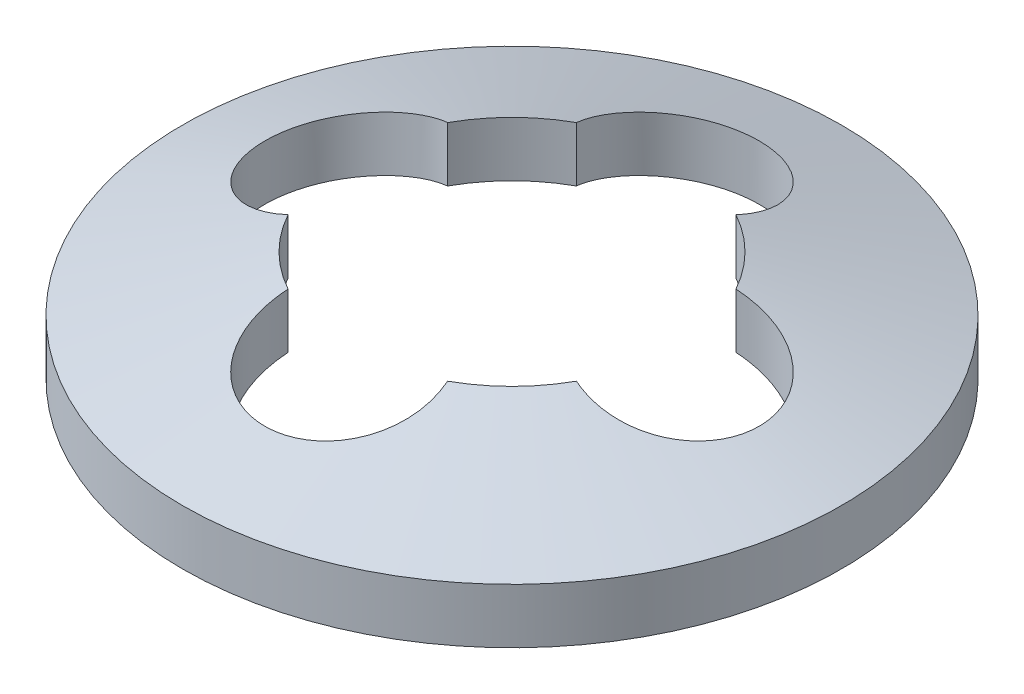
ISO-10303-21;
HEADER;
FILE_DESCRIPTION(('STEP AP214'),'2;1');
FILE_NAME('part.step','',(''),(''),'','','');
FILE_SCHEMA(('AUTOMOTIVE_DESIGN { 1 0 10303 214 1 1 1 1 }'));
ENDSEC;
DATA;
#1=APPLICATION_CONTEXT('core data for automotive mechanical design processes');
#2=APPLICATION_PROTOCOL_DEFINITION('international standard','automotive_design',2000,#1);
#3=PRODUCT_CONTEXT('',#1,'mechanical');
#4=PRODUCT('Part','Part','',(#3));
#5=PRODUCT_RELATED_PRODUCT_CATEGORY('part','',(#4));
#6=PRODUCT_DEFINITION_FORMATION('','',#4);
#7=PRODUCT_DEFINITION_CONTEXT('part definition',#1,'design');
#8=PRODUCT_DEFINITION('design','',#6,#7);
#9=PRODUCT_DEFINITION_SHAPE('','',#8);
#10=(LENGTH_UNIT() NAMED_UNIT(*) SI_UNIT(.MILLI.,.METRE.));
#11=(NAMED_UNIT(*) PLANE_ANGLE_UNIT() SI_UNIT($,.RADIAN.));
#12=(NAMED_UNIT(*) SI_UNIT($,.STERADIAN.) SOLID_ANGLE_UNIT());
#13=UNCERTAINTY_MEASURE_WITH_UNIT(LENGTH_MEASURE(1.E-05),#10,'distance_accuracy_value','');
#14=(GEOMETRIC_REPRESENTATION_CONTEXT(3) GLOBAL_UNCERTAINTY_ASSIGNED_CONTEXT((#13)) GLOBAL_UNIT_ASSIGNED_CONTEXT((#10,
#11,#12)) REPRESENTATION_CONTEXT('',''));
#15=CARTESIAN_POINT('',(0.,0.,0.));
#16=DIRECTION('',(0.,0.,1.));
#17=DIRECTION('',(1.,0.,0.));
#18=AXIS2_PLACEMENT_3D('',#15,#16,#17);
#19=CARTESIAN_POINT('',(3.,0.5,0.));
#20=DIRECTION('',(0.,-1.,0.));
#21=DIRECTION('',(0.,0.,-1.));
#22=AXIS2_PLACEMENT_3D('',#19,#20,#21);
#23=CYLINDRICAL_SURFACE('',#22,3.);
#24=CARTESIAN_POINT('',(3.,0.,0.));
#25=DIRECTION('',(0.,-1.,0.));
#26=DIRECTION('',(0.,0.,-1.));
#27=AXIS2_PLACEMENT_3D('',#24,#25,#26);
#28=CIRCLE('',#27,3.);
#29=CARTESIAN_POINT('',(3.,0.,-3.));
#30=VERTEX_POINT('',#29);
#31=EDGE_CURVE('E131',#30,#30,#28,.T.);
#32=ORIENTED_EDGE('',*,*,#31,.F.);
#33=EDGE_LOOP('',(#32));
#34=FACE_BOUND('',#33,.T.);
#35=CARTESIAN_POINT('',(3.,0.5,0.));
#36=DIRECTION('',(0.,-1.,0.));
#37=DIRECTION('',(0.,0.,-1.));
#38=AXIS2_PLACEMENT_3D('',#35,#36,#37);
#39=CIRCLE('',#38,3.);
#40=CARTESIAN_POINT('',(3.,0.5,-3.));
#41=VERTEX_POINT('',#40);
#42=EDGE_CURVE('E124',#41,#41,#39,.T.);
#43=ORIENTED_EDGE('',*,*,#42,.T.);
#44=EDGE_LOOP('',(#43));
#45=FACE_BOUND('',#44,.T.);
#46=ADVANCED_FACE('F33',(#34,#45),#23,.T.);
#47=CARTESIAN_POINT('',(3.,0.,0.));
#48=DIRECTION('',(0.,-1.,0.));
#49=DIRECTION('',(0.,0.,-1.));
#50=AXIS2_PLACEMENT_3D('',#47,#48,#49);
#51=CONICAL_SURFACE('',#50,3.,1.24904577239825);
#52=CARTESIAN_POINT('',(3.,0.5,0.));
#53=DIRECTION('',(0.,1.,0.));
#54=DIRECTION('',(0.,0.,1.));
#55=AXIS2_PLACEMENT_3D('',#52,#53,#54);
#56=CIRCLE('',#55,1.5);
#57=CARTESIAN_POINT('',(3.72618437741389,0.5,1.3125));
#58=VERTEX_POINT('',#57);
#59=CARTESIAN_POINT('',(4.3125,0.5,0.726184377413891));
#60=VERTEX_POINT('',#59);
#61=EDGE_CURVE('E181',#58,#60,#56,.T.);
#62=ORIENTED_EDGE('',*,*,#61,.T.);
#63=CARTESIAN_POINT('',(4.3123,0.500066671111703,0.726132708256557));
#64=CARTESIAN_POINT('',(4.35429872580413,0.486054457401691,0.737026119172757));
#65=CARTESIAN_POINT('',(4.39734683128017,0.472302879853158,0.744229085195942));
#66=CARTESIAN_POINT('',(4.48428779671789,0.445528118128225,0.751093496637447));
#67=CARTESIAN_POINT('',(4.52818110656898,0.432505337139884,0.750750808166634));
#68=CARTESIAN_POINT('',(4.6155595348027,0.407396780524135,0.742346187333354));
#69=CARTESIAN_POINT('',(4.65904412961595,0.395312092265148,0.734275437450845));
#70=CARTESIAN_POINT('',(4.74417347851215,0.372287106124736,0.71051366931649));
#71=CARTESIAN_POINT('',(4.78581935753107,0.361346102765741,0.694827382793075));
#72=CARTESIAN_POINT('',(4.86500437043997,0.34100890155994,0.656627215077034));
#73=CARTESIAN_POINT('',(4.90261661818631,0.331582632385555,0.634281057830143));
#74=CARTESIAN_POINT('',(4.9735961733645,0.314112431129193,0.583196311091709));
#75=CARTESIAN_POINT('',(5.0069632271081,0.306068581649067,0.554457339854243));
#76=CARTESIAN_POINT('',(5.06734375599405,0.291717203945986,0.492379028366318));
#77=CARTESIAN_POINT('',(5.09452383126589,0.28536308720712,0.459212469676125));
#78=CARTESIAN_POINT('',(5.14292513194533,0.274162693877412,0.388561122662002));
#79=CARTESIAN_POINT('',(5.16414775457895,0.269316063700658,0.351077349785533));
#80=CARTESIAN_POINT('',(5.19944605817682,0.261309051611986,0.273913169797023));
#81=CARTESIAN_POINT('',(5.21369390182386,0.258107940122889,0.234315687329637));
#82=CARTESIAN_POINT('',(5.23538363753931,0.25325117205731,0.153207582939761));
#83=CARTESIAN_POINT('',(5.24282611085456,0.251595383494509,0.11169712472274));
#84=CARTESIAN_POINT('',(5.25059208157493,0.249867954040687,0.0286686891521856));
#85=CARTESIAN_POINT('',(5.25102968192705,0.249770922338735,-0.0128381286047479));
#86=CARTESIAN_POINT('',(5.2450650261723,0.251097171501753,-0.0953312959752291));
#87=CARTESIAN_POINT('',(5.23866307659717,0.252520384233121,-0.136317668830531));
#88=CARTESIAN_POINT('',(5.2192682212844,0.256857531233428,-0.216437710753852));
#89=CARTESIAN_POINT('',(5.20630231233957,0.259765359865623,-0.255578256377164));
#90=CARTESIAN_POINT('',(5.17420850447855,0.267027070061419,-0.33109872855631));
#91=CARTESIAN_POINT('',(5.15508055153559,0.271380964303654,-0.367478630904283));
#92=CARTESIAN_POINT('',(5.11107537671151,0.281517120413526,-0.436790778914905));
#93=CARTESIAN_POINT('',(5.08615108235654,0.287311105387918,-0.469691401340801));
#94=CARTESIAN_POINT('',(5.03141350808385,0.300228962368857,-0.5308331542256));
#95=CARTESIAN_POINT('',(5.00159968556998,0.307352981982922,-0.559073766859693));
#96=CARTESIAN_POINT('',(4.93735345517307,0.322986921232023,-0.610698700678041));
#97=CARTESIAN_POINT('',(4.9028424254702,0.33152112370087,-0.633977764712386));
#98=CARTESIAN_POINT('',(4.83069606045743,0.349757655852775,-0.674426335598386));
#99=CARTESIAN_POINT('',(4.79306055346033,0.359460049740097,-0.691595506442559));
#100=CARTESIAN_POINT('',(4.71467759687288,0.380185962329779,-0.719858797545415));
#101=CARTESIAN_POINT('',(4.67387306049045,0.391238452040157,-0.730773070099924));
#102=CARTESIAN_POINT('',(4.59126638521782,0.41429110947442,-0.745608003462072));
#103=CARTESIAN_POINT('',(4.54946414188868,0.426291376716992,-0.749527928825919));
#104=CARTESIAN_POINT('',(4.47468639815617,0.448494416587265,-0.7503023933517));
#105=CARTESIAN_POINT('',(4.44167493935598,0.458555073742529,-0.74845149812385));
#106=CARTESIAN_POINT('',(4.37634886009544,0.479050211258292,-0.740469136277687));
#107=CARTESIAN_POINT('',(4.34403322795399,0.489484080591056,-0.734344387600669));
#108=CARTESIAN_POINT('',(4.3123,0.500066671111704,-0.726132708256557));
#109=B_SPLINE_CURVE_WITH_KNOTS('',3,(#63,#64,#65,#66,#67,#68,#69,#70,#71,#72,#73,#74,#75,#76,
#77,#78,#79,#80,#81,#82,#83,#84,#85,#86,#87,#88,#89,#90,#91,#92,#93,#94,#95,#96,#97,#98,#99,
#100,#101,#102,#103,#104,#105,#106,#107,#108),.UNSPECIFIED.,.F.,.F.,(4,2,2,2,2,2,2,2,2,2,2,2,2,
2,2,2,2,2,2,2,2,2,4),(0.,0.136638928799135,0.273352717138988,0.410222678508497,
0.547007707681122,0.680603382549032,0.814207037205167,0.9436156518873,1.07299389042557,
1.19899354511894,1.32498243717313,1.44891695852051,1.57284592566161,1.69626927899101,
1.81969371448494,1.94415783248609,2.06863577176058,2.19553728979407,2.3224457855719,
2.45284064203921,2.58324920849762,2.68666330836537,2.78991521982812),.UNSPECIFIED.);
#110=CARTESIAN_POINT('',(4.3125,0.5,-0.726184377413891));
#111=VERTEX_POINT('',#110);
#112=EDGE_CURVE('E219',#60,#111,#109,.T.);
#113=ORIENTED_EDGE('',*,*,#112,.T.);
#114=CARTESIAN_POINT('',(3.,0.5,0.));
#115=DIRECTION('',(0.,-1.,0.));
#116=DIRECTION('',(0.,0.,-1.));
#117=AXIS2_PLACEMENT_3D('',#114,#115,#116);
#118=CIRCLE('',#117,1.5);
#119=CARTESIAN_POINT('',(3.72618437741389,0.5,-1.3125));
#120=VERTEX_POINT('',#119);
#121=EDGE_CURVE('E123',#120,#111,#118,.T.);
#122=ORIENTED_EDGE('',*,*,#121,.F.);
#123=CARTESIAN_POINT('',(3.72613270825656,0.500066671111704,-1.3123));
#124=CARTESIAN_POINT('',(3.73702611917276,0.486054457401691,-1.35429872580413));
#125=CARTESIAN_POINT('',(3.74422908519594,0.472302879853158,-1.39734683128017));
#126=CARTESIAN_POINT('',(3.75109349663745,0.445528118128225,-1.48428779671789));
#127=CARTESIAN_POINT('',(3.75075080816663,0.432505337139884,-1.52818110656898));
#128=CARTESIAN_POINT('',(3.74234618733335,0.407396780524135,-1.6155595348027));
#129=CARTESIAN_POINT('',(3.73427543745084,0.395312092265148,-1.65904412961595));
#130=CARTESIAN_POINT('',(3.71051366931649,0.372287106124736,-1.74417347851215));
#131=CARTESIAN_POINT('',(3.69482738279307,0.361346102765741,-1.78581935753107));
#132=CARTESIAN_POINT('',(3.65662721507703,0.34100890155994,-1.86500437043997));
#133=CARTESIAN_POINT('',(3.63428105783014,0.331582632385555,-1.90261661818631));
#134=CARTESIAN_POINT('',(3.58319631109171,0.314112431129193,-1.9735961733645));
#135=CARTESIAN_POINT('',(3.55445733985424,0.306068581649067,-2.0069632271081));
#136=CARTESIAN_POINT('',(3.49237902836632,0.291717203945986,-2.06734375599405));
#137=CARTESIAN_POINT('',(3.45921246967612,0.28536308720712,-2.09452383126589));
#138=CARTESIAN_POINT('',(3.388561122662,0.274162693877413,-2.14292513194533));
#139=CARTESIAN_POINT('',(3.35107734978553,0.269316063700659,-2.16414775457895));
#140=CARTESIAN_POINT('',(3.27391316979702,0.261309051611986,-2.19944605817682));
#141=CARTESIAN_POINT('',(3.23431568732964,0.258107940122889,-2.21369390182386));
#142=CARTESIAN_POINT('',(3.15320758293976,0.25325117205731,-2.23538363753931));
#143=CARTESIAN_POINT('',(3.11169712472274,0.251595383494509,-2.24282611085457));
#144=CARTESIAN_POINT('',(3.02866868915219,0.249867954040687,-2.25059208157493));
#145=CARTESIAN_POINT('',(2.98716187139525,0.249770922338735,-2.25102968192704));
#146=CARTESIAN_POINT('',(2.90466870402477,0.251097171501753,-2.24506502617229));
#147=CARTESIAN_POINT('',(2.86368233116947,0.252520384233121,-2.23866307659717));
#148=CARTESIAN_POINT('',(2.78356228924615,0.256857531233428,-2.2192682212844));
#149=CARTESIAN_POINT('',(2.74442174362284,0.259765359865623,-2.20630231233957));
#150=CARTESIAN_POINT('',(2.66890127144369,0.267027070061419,-2.17420850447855));
#151=CARTESIAN_POINT('',(2.63252136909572,0.271380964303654,-2.15508055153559));
#152=CARTESIAN_POINT('',(2.5632092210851,0.281517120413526,-2.11107537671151));
#153=CARTESIAN_POINT('',(2.5303085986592,0.287311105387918,-2.08615108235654));
#154=CARTESIAN_POINT('',(2.4691668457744,0.300228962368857,-2.03141350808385));
#155=CARTESIAN_POINT('',(2.44092623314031,0.307352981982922,-2.00159968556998));
#156=CARTESIAN_POINT('',(2.38930129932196,0.322986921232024,-1.93735345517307));
#157=CARTESIAN_POINT('',(2.36602223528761,0.331521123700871,-1.9028424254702));
#158=CARTESIAN_POINT('',(2.32557366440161,0.349757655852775,-1.83069606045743));
#159=CARTESIAN_POINT('',(2.30840449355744,0.359460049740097,-1.79306055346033));
#160=CARTESIAN_POINT('',(2.28014120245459,0.380185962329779,-1.71467759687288));
#161=CARTESIAN_POINT('',(2.26922692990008,0.391238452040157,-1.67387306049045));
#162=CARTESIAN_POINT('',(2.25439199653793,0.41429110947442,-1.59126638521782));
#163=CARTESIAN_POINT('',(2.25047207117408,0.426291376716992,-1.54946414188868));
#164=CARTESIAN_POINT('',(2.2496976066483,0.448494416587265,-1.47468639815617));
#165=CARTESIAN_POINT('',(2.25154850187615,0.458555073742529,-1.44167493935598));
#166=CARTESIAN_POINT('',(2.25953086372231,0.479050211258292,-1.37634886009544));
#167=CARTESIAN_POINT('',(2.26565561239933,0.489484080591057,-1.34403322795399));
#168=CARTESIAN_POINT('',(2.27386729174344,0.500066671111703,-1.3123));
#169=B_SPLINE_CURVE_WITH_KNOTS('',3,(#123,#124,#125,#126,#127,#128,#129,#130,#131,#132,#133,
#134,#135,#136,#137,#138,#139,#140,#141,#142,#143,#144,#145,#146,#147,#148,#149,#150,#151,#152,
#153,#154,#155,#156,#157,#158,#159,#160,#161,#162,#163,#164,#165,#166,#167,#168),.UNSPECIFIED.,
.F.,.F.,(4,2,2,2,2,2,2,2,2,2,2,2,2,2,2,2,2,2,2,2,2,2,4),(0.,0.136638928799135,0.273352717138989,
0.410222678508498,0.547007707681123,0.680603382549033,0.814207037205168,0.9436156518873,
1.07299389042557,1.19899354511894,1.32498243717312,1.44891695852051,1.57284592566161,
1.69626927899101,1.81969371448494,1.94415783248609,2.06863577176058,2.19553728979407,
2.3224457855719,2.45284064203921,2.58324920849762,2.68666330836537,2.78991521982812),.UNSPECIFIED.);
#170=CARTESIAN_POINT('',(2.27381562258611,0.5,-1.3125));
#171=VERTEX_POINT('',#170);
#172=EDGE_CURVE('E110',#120,#171,#169,.T.);
#173=ORIENTED_EDGE('',*,*,#172,.T.);
#174=CARTESIAN_POINT('',(3.,0.5,0.));
#175=DIRECTION('',(0.,1.,0.));
#176=DIRECTION('',(0.,0.,1.));
#177=AXIS2_PLACEMENT_3D('',#174,#175,#176);
#178=CIRCLE('',#177,1.5);
#179=CARTESIAN_POINT('',(1.6875,0.5,-0.726184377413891));
#180=VERTEX_POINT('',#179);
#181=EDGE_CURVE('E157',#171,#180,#178,.T.);
#182=ORIENTED_EDGE('',*,*,#181,.T.);
#183=CARTESIAN_POINT('',(1.6877,0.500066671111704,-0.726132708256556));
#184=CARTESIAN_POINT('',(1.64570127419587,0.486054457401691,-0.737026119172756));
#185=CARTESIAN_POINT('',(1.60265316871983,0.472302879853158,-0.744229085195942));
#186=CARTESIAN_POINT('',(1.51571220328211,0.445528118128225,-0.751093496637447));
#187=CARTESIAN_POINT('',(1.47181889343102,0.432505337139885,-0.750750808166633));
#188=CARTESIAN_POINT('',(1.3844404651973,0.407396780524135,-0.742346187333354));
#189=CARTESIAN_POINT('',(1.34095587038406,0.395312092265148,-0.734275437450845));
#190=CARTESIAN_POINT('',(1.25582652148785,0.372287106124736,-0.71051366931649));
#191=CARTESIAN_POINT('',(1.21418064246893,0.361346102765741,-0.694827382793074));
#192=CARTESIAN_POINT('',(1.13499562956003,0.34100890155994,-0.656627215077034));
#193=CARTESIAN_POINT('',(1.09738338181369,0.331582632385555,-0.634281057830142));
#194=CARTESIAN_POINT('',(1.0264038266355,0.314112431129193,-0.583196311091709));
#195=CARTESIAN_POINT('',(0.993036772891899,0.306068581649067,-0.554457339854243));
#196=CARTESIAN_POINT('',(0.932656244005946,0.291717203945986,-0.492379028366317));
#197=CARTESIAN_POINT('',(0.905476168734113,0.28536308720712,-0.459212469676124));
#198=CARTESIAN_POINT('',(0.857074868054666,0.274162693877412,-0.388561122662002));
#199=CARTESIAN_POINT('',(0.835852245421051,0.269316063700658,-0.351077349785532));
#200=CARTESIAN_POINT('',(0.800553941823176,0.261309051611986,-0.273913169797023));
#201=CARTESIAN_POINT('',(0.786306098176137,0.258107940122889,-0.234315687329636));
#202=CARTESIAN_POINT('',(0.764616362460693,0.25325117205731,-0.15320758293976));
#203=CARTESIAN_POINT('',(0.757173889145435,0.251595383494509,-0.11169712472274));
#204=CARTESIAN_POINT('',(0.749407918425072,0.249867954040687,-0.0286686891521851));
#205=CARTESIAN_POINT('',(0.748970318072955,0.249770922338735,0.0128381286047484));
#206=CARTESIAN_POINT('',(0.754934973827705,0.251097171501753,0.0953312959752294));
#207=CARTESIAN_POINT('',(0.761336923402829,0.252520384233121,0.136317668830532));
#208=CARTESIAN_POINT('',(0.780731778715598,0.256857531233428,0.216437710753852));
#209=CARTESIAN_POINT('',(0.793697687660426,0.259765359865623,0.255578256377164));
#210=CARTESIAN_POINT('',(0.825791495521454,0.267027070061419,0.33109872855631));
#211=CARTESIAN_POINT('',(0.844919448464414,0.271380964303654,0.367478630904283));
#212=CARTESIAN_POINT('',(0.888924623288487,0.281517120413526,0.436790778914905));
#213=CARTESIAN_POINT('',(0.913848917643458,0.287311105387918,0.469691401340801));
#214=CARTESIAN_POINT('',(0.968586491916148,0.300228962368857,0.530833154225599));
#215=CARTESIAN_POINT('',(0.998400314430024,0.307352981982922,0.559073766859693));
#216=CARTESIAN_POINT('',(1.06264654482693,0.322986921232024,0.610698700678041));
#217=CARTESIAN_POINT('',(1.0971575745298,0.331521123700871,0.633977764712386));
#218=CARTESIAN_POINT('',(1.16930393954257,0.349757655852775,0.674426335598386));
#219=CARTESIAN_POINT('',(1.20693944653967,0.359460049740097,0.691595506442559));
#220=CARTESIAN_POINT('',(1.28532240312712,0.380185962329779,0.719858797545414));
#221=CARTESIAN_POINT('',(1.32612693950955,0.391238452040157,0.730773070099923));
#222=CARTESIAN_POINT('',(1.40873361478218,0.41429110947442,0.745608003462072));
#223=CARTESIAN_POINT('',(1.45053585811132,0.426291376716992,0.749527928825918));
#224=CARTESIAN_POINT('',(1.52531360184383,0.448494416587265,0.750302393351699));
#225=CARTESIAN_POINT('',(1.55832506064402,0.458555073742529,0.748451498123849));
#226=CARTESIAN_POINT('',(1.62365113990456,0.479050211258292,0.740469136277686));
#227=CARTESIAN_POINT('',(1.65596677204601,0.489484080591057,0.734344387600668));
#228=CARTESIAN_POINT('',(1.6877,0.500066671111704,0.726132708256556));
#229=B_SPLINE_CURVE_WITH_KNOTS('',3,(#183,#184,#185,#186,#187,#188,#189,#190,#191,#192,#193,
#194,#195,#196,#197,#198,#199,#200,#201,#202,#203,#204,#205,#206,#207,#208,#209,#210,#211,#212,
#213,#214,#215,#216,#217,#218,#219,#220,#221,#222,#223,#224,#225,#226,#227,#228),.UNSPECIFIED.,
.F.,.F.,(4,2,2,2,2,2,2,2,2,2,2,2,2,2,2,2,2,2,2,2,2,2,4),(0.,0.136638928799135,0.273352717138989,
0.410222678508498,0.547007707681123,0.680603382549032,0.814207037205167,0.943615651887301,
1.07299389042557,1.19899354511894,1.32498243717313,1.44891695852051,1.57284592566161,
1.69626927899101,1.81969371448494,1.94415783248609,2.06863577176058,2.19553728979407,
2.3224457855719,2.45284064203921,2.58324920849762,2.68666330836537,2.78991521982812),.UNSPECIFIED.);
#230=CARTESIAN_POINT('',(1.6875,0.5,0.726184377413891));
#231=VERTEX_POINT('',#230);
#232=EDGE_CURVE('E168',#180,#231,#229,.T.);
#233=ORIENTED_EDGE('',*,*,#232,.T.);
#234=CARTESIAN_POINT('',(3.,0.5,0.));
#235=DIRECTION('',(0.,1.,0.));
#236=DIRECTION('',(0.,0.,1.));
#237=AXIS2_PLACEMENT_3D('',#234,#235,#236);
#238=CIRCLE('',#237,1.5);
#239=CARTESIAN_POINT('',(2.27381562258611,0.5,1.3125));
#240=VERTEX_POINT('',#239);
#241=EDGE_CURVE('E182',#231,#240,#238,.T.);
#242=ORIENTED_EDGE('',*,*,#241,.T.);
#243=CARTESIAN_POINT('',(2.27386729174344,0.500066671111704,1.3123));
#244=CARTESIAN_POINT('',(2.26297388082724,0.486054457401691,1.35429872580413));
#245=CARTESIAN_POINT('',(2.25577091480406,0.472302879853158,1.39734683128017));
#246=CARTESIAN_POINT('',(2.24890650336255,0.445528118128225,1.48428779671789));
#247=CARTESIAN_POINT('',(2.24924919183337,0.432505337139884,1.52818110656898));
#248=CARTESIAN_POINT('',(2.25765381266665,0.407396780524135,1.6155595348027));
#249=CARTESIAN_POINT('',(2.26572456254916,0.395312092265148,1.65904412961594));
#250=CARTESIAN_POINT('',(2.28948633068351,0.372287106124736,1.74417347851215));
#251=CARTESIAN_POINT('',(2.30517261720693,0.361346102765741,1.78581935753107));
#252=CARTESIAN_POINT('',(2.34337278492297,0.34100890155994,1.86500437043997));
#253=CARTESIAN_POINT('',(2.36571894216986,0.331582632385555,1.90261661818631));
#254=CARTESIAN_POINT('',(2.41680368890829,0.314112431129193,1.9735961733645));
#255=CARTESIAN_POINT('',(2.44554266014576,0.306068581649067,2.0069632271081));
#256=CARTESIAN_POINT('',(2.50762097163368,0.291717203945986,2.06734375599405));
#257=CARTESIAN_POINT('',(2.54078753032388,0.28536308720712,2.09452383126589));
#258=CARTESIAN_POINT('',(2.611438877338,0.274162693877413,2.14292513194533));
#259=CARTESIAN_POINT('',(2.64892265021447,0.269316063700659,2.16414775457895));
#260=CARTESIAN_POINT('',(2.72608683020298,0.261309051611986,2.19944605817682));
#261=CARTESIAN_POINT('',(2.76568431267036,0.258107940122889,2.21369390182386));
#262=CARTESIAN_POINT('',(2.84679241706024,0.25325117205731,2.23538363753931));
#263=CARTESIAN_POINT('',(2.88830287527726,0.251595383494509,2.24282611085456));
#264=CARTESIAN_POINT('',(2.97133131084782,0.249867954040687,2.25059208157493));
#265=CARTESIAN_POINT('',(3.01283812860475,0.249770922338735,2.25102968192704));
#266=CARTESIAN_POINT('',(3.09533129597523,0.251097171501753,2.24506502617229));
#267=CARTESIAN_POINT('',(3.13631766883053,0.252520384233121,2.23866307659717));
#268=CARTESIAN_POINT('',(3.21643771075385,0.256857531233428,2.2192682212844));
#269=CARTESIAN_POINT('',(3.25557825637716,0.259765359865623,2.20630231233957));
#270=CARTESIAN_POINT('',(3.33109872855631,0.267027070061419,2.17420850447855));
#271=CARTESIAN_POINT('',(3.36747863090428,0.271380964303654,2.15508055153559));
#272=CARTESIAN_POINT('',(3.4367907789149,0.281517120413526,2.11107537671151));
#273=CARTESIAN_POINT('',(3.4696914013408,0.287311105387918,2.08615108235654));
#274=CARTESIAN_POINT('',(3.5308331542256,0.300228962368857,2.03141350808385));
#275=CARTESIAN_POINT('',(3.55907376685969,0.307352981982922,2.00159968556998));
#276=CARTESIAN_POINT('',(3.61069870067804,0.322986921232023,1.93735345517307));
#277=CARTESIAN_POINT('',(3.63397776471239,0.331521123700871,1.9028424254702));
#278=CARTESIAN_POINT('',(3.67442633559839,0.349757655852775,1.83069606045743));
#279=CARTESIAN_POINT('',(3.69159550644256,0.359460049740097,1.79306055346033));
#280=CARTESIAN_POINT('',(3.71985879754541,0.380185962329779,1.71467759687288));
#281=CARTESIAN_POINT('',(3.73077307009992,0.391238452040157,1.67387306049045));
#282=CARTESIAN_POINT('',(3.74560800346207,0.41429110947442,1.59126638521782));
#283=CARTESIAN_POINT('',(3.74952792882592,0.426291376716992,1.54946414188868));
#284=CARTESIAN_POINT('',(3.7503023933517,0.448494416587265,1.47468639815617));
#285=CARTESIAN_POINT('',(3.74845149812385,0.458555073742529,1.44167493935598));
#286=CARTESIAN_POINT('',(3.74046913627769,0.479050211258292,1.37634886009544));
#287=CARTESIAN_POINT('',(3.73434438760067,0.489484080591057,1.34403322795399));
#288=CARTESIAN_POINT('',(3.72613270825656,0.500066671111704,1.3123));
#289=B_SPLINE_CURVE_WITH_KNOTS('',3,(#243,#244,#245,#246,#247,#248,#249,#250,#251,#252,#253,
#254,#255,#256,#257,#258,#259,#260,#261,#262,#263,#264,#265,#266,#267,#268,#269,#270,#271,#272,
#273,#274,#275,#276,#277,#278,#279,#280,#281,#282,#283,#284,#285,#286,#287,#288),.UNSPECIFIED.,
.F.,.F.,(4,2,2,2,2,2,2,2,2,2,2,2,2,2,2,2,2,2,2,2,2,2,4),(0.,0.136638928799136,0.273352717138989,
0.410222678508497,0.547007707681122,0.680603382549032,0.814207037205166,0.9436156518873,
1.07299389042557,1.19899354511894,1.32498243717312,1.44891695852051,1.57284592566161,
1.69626927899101,1.81969371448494,1.94415783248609,2.06863577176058,2.19553728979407,
2.3224457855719,2.45284064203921,2.58324920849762,2.68666330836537,2.78991521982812),.UNSPECIFIED.);
#290=EDGE_CURVE('E174',#240,#58,#289,.T.);
#291=ORIENTED_EDGE('',*,*,#290,.T.);
#292=EDGE_LOOP('',(#62,#113,#122,#173,#182,#233,#242,#291));
#293=FACE_BOUND('',#292,.T.);
#294=ORIENTED_EDGE('',*,*,#31,.T.);
#295=EDGE_LOOP('',(#294));
#296=FACE_BOUND('',#295,.T.);
#297=ADVANCED_FACE('F160',(#293,#296),#51,.F.);
#298=CARTESIAN_POINT('',(3.,1.,0.));
#299=DIRECTION('',(0.,-1.,0.));
#300=DIRECTION('',(0.,0.,-1.));
#301=AXIS2_PLACEMENT_3D('',#298,#299,#300);
#302=CONICAL_SURFACE('',#301,1.5,1.24904577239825);
#303=ORIENTED_EDGE('',*,*,#42,.F.);
#304=EDGE_LOOP('',(#303));
#305=FACE_BOUND('',#304,.T.);
#306=CARTESIAN_POINT('',(3.,1.,0.));
#307=DIRECTION('',(0.,-1.,0.));
#308=DIRECTION('',(0.,0.,-1.));
#309=AXIS2_PLACEMENT_3D('',#306,#307,#308);
#310=CIRCLE('',#309,1.5);
#311=CARTESIAN_POINT('',(3.72618437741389,1.,-1.3125));
#312=VERTEX_POINT('',#311);
#313=CARTESIAN_POINT('',(4.3125,1.,-0.726184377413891));
#314=VERTEX_POINT('',#313);
#315=EDGE_CURVE('E118',#312,#314,#310,.T.);
#316=ORIENTED_EDGE('',*,*,#315,.T.);
#317=CARTESIAN_POINT('',(4.3123,1.0000666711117,-0.726132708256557));
#318=CARTESIAN_POINT('',(4.35429872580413,0.98605445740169,-0.737026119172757));
#319=CARTESIAN_POINT('',(4.39734683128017,0.972302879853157,-0.744229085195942));
#320=CARTESIAN_POINT('',(4.48428779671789,0.945528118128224,-0.751093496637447));
#321=CARTESIAN_POINT('',(4.52818110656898,0.932505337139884,-0.750750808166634));
#322=CARTESIAN_POINT('',(4.6155595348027,0.907396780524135,-0.742346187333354));
#323=CARTESIAN_POINT('',(4.65904412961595,0.895312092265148,-0.734275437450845));
#324=CARTESIAN_POINT('',(4.74417347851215,0.872287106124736,-0.710513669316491));
#325=CARTESIAN_POINT('',(4.78581935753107,0.861346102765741,-0.694827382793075));
#326=CARTESIAN_POINT('',(4.86500437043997,0.84100890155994,-0.656627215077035));
#327=CARTESIAN_POINT('',(4.90261661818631,0.831582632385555,-0.634281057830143));
#328=CARTESIAN_POINT('',(4.9735961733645,0.814112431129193,-0.58319631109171));
#329=CARTESIAN_POINT('',(5.0069632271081,0.806068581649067,-0.554457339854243));
#330=CARTESIAN_POINT('',(5.06734375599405,0.791717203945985,-0.492379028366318));
#331=CARTESIAN_POINT('',(5.09452383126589,0.78536308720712,-0.459212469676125));
#332=CARTESIAN_POINT('',(5.14292513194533,0.774162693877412,-0.388561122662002));
#333=CARTESIAN_POINT('',(5.16414775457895,0.769316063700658,-0.351077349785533));
#334=CARTESIAN_POINT('',(5.19944605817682,0.761309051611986,-0.273913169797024));
#335=CARTESIAN_POINT('',(5.21369390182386,0.758107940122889,-0.234315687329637));
#336=CARTESIAN_POINT('',(5.23538363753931,0.75325117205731,-0.153207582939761));
#337=CARTESIAN_POINT('',(5.24282611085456,0.751595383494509,-0.11169712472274));
#338=CARTESIAN_POINT('',(5.25059208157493,0.749867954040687,-0.0286686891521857));
#339=CARTESIAN_POINT('',(5.25102968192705,0.749770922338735,0.0128381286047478));
#340=CARTESIAN_POINT('',(5.2450650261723,0.751097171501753,0.095331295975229));
#341=CARTESIAN_POINT('',(5.23866307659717,0.752520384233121,0.136317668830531));
#342=CARTESIAN_POINT('',(5.2192682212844,0.756857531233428,0.216437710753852));
#343=CARTESIAN_POINT('',(5.20630231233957,0.759765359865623,0.255578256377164));
#344=CARTESIAN_POINT('',(5.17420850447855,0.767027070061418,0.33109872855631));
#345=CARTESIAN_POINT('',(5.15508055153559,0.771380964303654,0.367478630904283));
#346=CARTESIAN_POINT('',(5.11107537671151,0.781517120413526,0.436790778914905));
#347=CARTESIAN_POINT('',(5.08615108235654,0.787311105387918,0.469691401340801));
#348=CARTESIAN_POINT('',(5.03141350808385,0.800228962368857,0.530833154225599));
#349=CARTESIAN_POINT('',(5.00159968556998,0.807352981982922,0.559073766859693));
#350=CARTESIAN_POINT('',(4.93735345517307,0.822986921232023,0.610698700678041));
#351=CARTESIAN_POINT('',(4.9028424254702,0.83152112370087,0.633977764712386));
#352=CARTESIAN_POINT('',(4.83069606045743,0.849757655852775,0.674426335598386));
#353=CARTESIAN_POINT('',(4.79306055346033,0.859460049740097,0.691595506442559));
#354=CARTESIAN_POINT('',(4.71467759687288,0.880185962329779,0.719858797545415));
#355=CARTESIAN_POINT('',(4.67387306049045,0.891238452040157,0.730773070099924));
#356=CARTESIAN_POINT('',(4.59126638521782,0.914291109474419,0.745608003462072));
#357=CARTESIAN_POINT('',(4.54946414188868,0.926291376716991,0.749527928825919));
#358=CARTESIAN_POINT('',(4.47468639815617,0.948494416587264,0.7503023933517));
#359=CARTESIAN_POINT('',(4.44167493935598,0.958555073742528,0.74845149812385));
#360=CARTESIAN_POINT('',(4.37634886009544,0.979050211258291,0.740469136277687));
#361=CARTESIAN_POINT('',(4.34403322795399,0.989484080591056,0.734344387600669));
#362=CARTESIAN_POINT('',(4.3123,1.0000666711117,0.726132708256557));
#363=B_SPLINE_CURVE_WITH_KNOTS('',3,(#317,#318,#319,#320,#321,#322,#323,#324,#325,#326,#327,
#328,#329,#330,#331,#332,#333,#334,#335,#336,#337,#338,#339,#340,#341,#342,#343,#344,#345,#346,
#347,#348,#349,#350,#351,#352,#353,#354,#355,#356,#357,#358,#359,#360,#361,#362),.UNSPECIFIED.,
.F.,.F.,(4,2,2,2,2,2,2,2,2,2,2,2,2,2,2,2,2,2,2,2,2,2,4),(0.,0.136638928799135,0.273352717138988,
0.410222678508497,0.547007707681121,0.680603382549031,0.814207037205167,0.943615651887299,
1.07299389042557,1.19899354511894,1.32498243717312,1.44891695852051,1.57284592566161,
1.69626927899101,1.81969371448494,1.94415783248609,2.06863577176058,2.19553728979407,
2.3224457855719,2.45284064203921,2.58324920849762,2.68666330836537,2.78991521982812),.UNSPECIFIED.);
#364=CARTESIAN_POINT('',(4.3125,1.,0.726184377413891));
#365=VERTEX_POINT('',#364);
#366=EDGE_CURVE('E11',#314,#365,#363,.T.);
#367=ORIENTED_EDGE('',*,*,#366,.T.);
#368=CARTESIAN_POINT('',(3.,1.,0.));
#369=DIRECTION('',(0.,1.,0.));
#370=DIRECTION('',(0.,0.,1.));
#371=AXIS2_PLACEMENT_3D('',#368,#369,#370);
#372=CIRCLE('',#371,1.5);
#373=CARTESIAN_POINT('',(3.72618437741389,1.,1.3125));
#374=VERTEX_POINT('',#373);
#375=EDGE_CURVE('E114',#374,#365,#372,.T.);
#376=ORIENTED_EDGE('',*,*,#375,.F.);
#377=CARTESIAN_POINT('',(3.72613270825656,1.0000666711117,1.3123));
#378=CARTESIAN_POINT('',(3.73702611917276,0.986054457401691,1.35429872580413));
#379=CARTESIAN_POINT('',(3.74422908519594,0.972302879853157,1.39734683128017));
#380=CARTESIAN_POINT('',(3.75109349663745,0.945528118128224,1.48428779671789));
#381=CARTESIAN_POINT('',(3.75075080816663,0.932505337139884,1.52818110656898));
#382=CARTESIAN_POINT('',(3.74234618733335,0.907396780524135,1.6155595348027));
#383=CARTESIAN_POINT('',(3.73427543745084,0.895312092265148,1.65904412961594));
#384=CARTESIAN_POINT('',(3.71051366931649,0.872287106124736,1.74417347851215));
#385=CARTESIAN_POINT('',(3.69482738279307,0.861346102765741,1.78581935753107));
#386=CARTESIAN_POINT('',(3.65662721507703,0.84100890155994,1.86500437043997));
#387=CARTESIAN_POINT('',(3.63428105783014,0.831582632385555,1.90261661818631));
#388=CARTESIAN_POINT('',(3.58319631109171,0.814112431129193,1.9735961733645));
#389=CARTESIAN_POINT('',(3.55445733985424,0.806068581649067,2.0069632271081));
#390=CARTESIAN_POINT('',(3.49237902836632,0.791717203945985,2.06734375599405));
#391=CARTESIAN_POINT('',(3.45921246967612,0.78536308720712,2.09452383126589));
#392=CARTESIAN_POINT('',(3.388561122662,0.774162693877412,2.14292513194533));
#393=CARTESIAN_POINT('',(3.35107734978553,0.769316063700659,2.16414775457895));
#394=CARTESIAN_POINT('',(3.27391316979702,0.761309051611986,2.19944605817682));
#395=CARTESIAN_POINT('',(3.23431568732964,0.758107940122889,2.21369390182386));
#396=CARTESIAN_POINT('',(3.15320758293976,0.75325117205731,2.23538363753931));
#397=CARTESIAN_POINT('',(3.11169712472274,0.751595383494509,2.24282611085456));
#398=CARTESIAN_POINT('',(3.02866868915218,0.749867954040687,2.25059208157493));
#399=CARTESIAN_POINT('',(2.98716187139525,0.749770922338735,2.25102968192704));
#400=CARTESIAN_POINT('',(2.90466870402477,0.751097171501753,2.24506502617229));
#401=CARTESIAN_POINT('',(2.86368233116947,0.752520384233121,2.23866307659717));
#402=CARTESIAN_POINT('',(2.78356228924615,0.756857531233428,2.2192682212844));
#403=CARTESIAN_POINT('',(2.74442174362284,0.759765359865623,2.20630231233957));
#404=CARTESIAN_POINT('',(2.66890127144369,0.767027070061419,2.17420850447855));
#405=CARTESIAN_POINT('',(2.63252136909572,0.771380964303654,2.15508055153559));
#406=CARTESIAN_POINT('',(2.5632092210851,0.781517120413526,2.11107537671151));
#407=CARTESIAN_POINT('',(2.5303085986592,0.787311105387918,2.08615108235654));
#408=CARTESIAN_POINT('',(2.4691668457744,0.800228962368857,2.03141350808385));
#409=CARTESIAN_POINT('',(2.44092623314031,0.807352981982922,2.00159968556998));
#410=CARTESIAN_POINT('',(2.38930129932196,0.822986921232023,1.93735345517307));
#411=CARTESIAN_POINT('',(2.36602223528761,0.83152112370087,1.9028424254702));
#412=CARTESIAN_POINT('',(2.32557366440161,0.849757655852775,1.83069606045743));
#413=CARTESIAN_POINT('',(2.30840449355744,0.859460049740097,1.79306055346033));
#414=CARTESIAN_POINT('',(2.28014120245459,0.880185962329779,1.71467759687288));
#415=CARTESIAN_POINT('',(2.26922692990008,0.891238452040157,1.67387306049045));
#416=CARTESIAN_POINT('',(2.25439199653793,0.914291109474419,1.59126638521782));
#417=CARTESIAN_POINT('',(2.25047207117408,0.926291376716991,1.54946414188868));
#418=CARTESIAN_POINT('',(2.2496976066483,0.948494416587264,1.47468639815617));
#419=CARTESIAN_POINT('',(2.25154850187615,0.958555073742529,1.44167493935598));
#420=CARTESIAN_POINT('',(2.25953086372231,0.979050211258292,1.37634886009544));
#421=CARTESIAN_POINT('',(2.26565561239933,0.989484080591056,1.34403322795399));
#422=CARTESIAN_POINT('',(2.27386729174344,1.0000666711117,1.3123));
#423=B_SPLINE_CURVE_WITH_KNOTS('',3,(#377,#378,#379,#380,#381,#382,#383,#384,#385,#386,#387,
#388,#389,#390,#391,#392,#393,#394,#395,#396,#397,#398,#399,#400,#401,#402,#403,#404,#405,#406,
#407,#408,#409,#410,#411,#412,#413,#414,#415,#416,#417,#418,#419,#420,#421,#422),.UNSPECIFIED.,
.F.,.F.,(4,2,2,2,2,2,2,2,2,2,2,2,2,2,2,2,2,2,2,2,2,2,4),(0.,0.136638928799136,0.273352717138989,
0.410222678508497,0.547007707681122,0.680603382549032,0.814207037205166,0.9436156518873,
1.07299389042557,1.19899354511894,1.32498243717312,1.44891695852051,1.57284592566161,
1.69626927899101,1.81969371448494,1.94415783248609,2.06863577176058,2.19553728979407,
2.3224457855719,2.45284064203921,2.58324920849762,2.68666330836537,2.78991521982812),.UNSPECIFIED.);
#424=CARTESIAN_POINT('',(2.27381562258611,1.,1.3125));
#425=VERTEX_POINT('',#424);
#426=EDGE_CURVE('E45',#374,#425,#423,.T.);
#427=ORIENTED_EDGE('',*,*,#426,.T.);
#428=CARTESIAN_POINT('',(3.,1.,0.));
#429=DIRECTION('',(0.,1.,0.));
#430=DIRECTION('',(0.,0.,1.));
#431=AXIS2_PLACEMENT_3D('',#428,#429,#430);
#432=CIRCLE('',#431,1.5);
#433=CARTESIAN_POINT('',(1.6875,1.,0.726184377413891));
#434=VERTEX_POINT('',#433);
#435=EDGE_CURVE('E198',#434,#425,#432,.T.);
#436=ORIENTED_EDGE('',*,*,#435,.F.);
#437=CARTESIAN_POINT('',(1.6877,1.0000666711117,0.726132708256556));
#438=CARTESIAN_POINT('',(1.64570127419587,0.986054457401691,0.737026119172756));
#439=CARTESIAN_POINT('',(1.60265316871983,0.972302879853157,0.744229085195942));
#440=CARTESIAN_POINT('',(1.51571220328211,0.945528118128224,0.751093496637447));
#441=CARTESIAN_POINT('',(1.47181889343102,0.932505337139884,0.750750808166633));
#442=CARTESIAN_POINT('',(1.3844404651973,0.907396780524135,0.742346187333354));
#443=CARTESIAN_POINT('',(1.34095587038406,0.895312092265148,0.734275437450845));
#444=CARTESIAN_POINT('',(1.25582652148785,0.872287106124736,0.71051366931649));
#445=CARTESIAN_POINT('',(1.21418064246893,0.861346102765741,0.694827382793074));
#446=CARTESIAN_POINT('',(1.13499562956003,0.841008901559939,0.656627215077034));
#447=CARTESIAN_POINT('',(1.09738338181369,0.831582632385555,0.634281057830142));
#448=CARTESIAN_POINT('',(1.0264038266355,0.814112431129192,0.583196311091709));
#449=CARTESIAN_POINT('',(0.993036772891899,0.806068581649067,0.554457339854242));
#450=CARTESIAN_POINT('',(0.932656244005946,0.791717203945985,0.492379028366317));
#451=CARTESIAN_POINT('',(0.905476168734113,0.78536308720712,0.459212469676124));
#452=CARTESIAN_POINT('',(0.857074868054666,0.774162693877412,0.388561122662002));
#453=CARTESIAN_POINT('',(0.83585224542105,0.769316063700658,0.351077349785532));
#454=CARTESIAN_POINT('',(0.800553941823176,0.761309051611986,0.273913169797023));
#455=CARTESIAN_POINT('',(0.786306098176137,0.758107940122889,0.234315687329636));
#456=CARTESIAN_POINT('',(0.764616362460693,0.75325117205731,0.15320758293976));
#457=CARTESIAN_POINT('',(0.757173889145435,0.751595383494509,0.11169712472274));
#458=CARTESIAN_POINT('',(0.749407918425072,0.749867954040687,0.028668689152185));
#459=CARTESIAN_POINT('',(0.748970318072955,0.749770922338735,-0.0128381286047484));
#460=CARTESIAN_POINT('',(0.754934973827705,0.751097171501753,-0.0953312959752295));
#461=CARTESIAN_POINT('',(0.761336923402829,0.752520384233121,-0.136317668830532));
#462=CARTESIAN_POINT('',(0.780731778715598,0.756857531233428,-0.216437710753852));
#463=CARTESIAN_POINT('',(0.793697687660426,0.759765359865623,-0.255578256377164));
#464=CARTESIAN_POINT('',(0.825791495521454,0.767027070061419,-0.33109872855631));
#465=CARTESIAN_POINT('',(0.844919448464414,0.771380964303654,-0.367478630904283));
#466=CARTESIAN_POINT('',(0.888924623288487,0.781517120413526,-0.436790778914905));
#467=CARTESIAN_POINT('',(0.913848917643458,0.787311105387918,-0.469691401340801));
#468=CARTESIAN_POINT('',(0.968586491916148,0.800228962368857,-0.5308331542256));
#469=CARTESIAN_POINT('',(0.998400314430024,0.807352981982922,-0.559073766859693));
#470=CARTESIAN_POINT('',(1.06264654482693,0.822986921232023,-0.610698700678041));
#471=CARTESIAN_POINT('',(1.0971575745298,0.831521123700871,-0.633977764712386));
#472=CARTESIAN_POINT('',(1.16930393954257,0.849757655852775,-0.674426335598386));
#473=CARTESIAN_POINT('',(1.20693944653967,0.859460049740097,-0.691595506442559));
#474=CARTESIAN_POINT('',(1.28532240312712,0.880185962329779,-0.719858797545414));
#475=CARTESIAN_POINT('',(1.32612693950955,0.891238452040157,-0.730773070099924));
#476=CARTESIAN_POINT('',(1.40873361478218,0.91429110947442,-0.745608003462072));
#477=CARTESIAN_POINT('',(1.45053585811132,0.926291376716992,-0.749527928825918));
#478=CARTESIAN_POINT('',(1.52531360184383,0.948494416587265,-0.750302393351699));
#479=CARTESIAN_POINT('',(1.55832506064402,0.958555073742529,-0.748451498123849));
#480=CARTESIAN_POINT('',(1.62365113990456,0.979050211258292,-0.740469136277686));
#481=CARTESIAN_POINT('',(1.65596677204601,0.989484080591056,-0.734344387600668));
#482=CARTESIAN_POINT('',(1.6877,1.0000666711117,-0.726132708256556));
#483=B_SPLINE_CURVE_WITH_KNOTS('',3,(#437,#438,#439,#440,#441,#442,#443,#444,#445,#446,#447,
#448,#449,#450,#451,#452,#453,#454,#455,#456,#457,#458,#459,#460,#461,#462,#463,#464,#465,#466,
#467,#468,#469,#470,#471,#472,#473,#474,#475,#476,#477,#478,#479,#480,#481,#482),.UNSPECIFIED.,
.F.,.F.,(4,2,2,2,2,2,2,2,2,2,2,2,2,2,2,2,2,2,2,2,2,2,4),(0.,0.136638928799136,0.273352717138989,
0.410222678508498,0.547007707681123,0.680603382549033,0.814207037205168,0.943615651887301,
1.07299389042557,1.19899354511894,1.32498243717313,1.44891695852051,1.57284592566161,
1.69626927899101,1.81969371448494,1.94415783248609,2.06863577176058,2.19553728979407,
2.3224457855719,2.45284064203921,2.58324920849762,2.68666330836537,2.78991521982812),.UNSPECIFIED.);
#484=CARTESIAN_POINT('',(1.6875,1.,-0.726184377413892));
#485=VERTEX_POINT('',#484);
#486=EDGE_CURVE('E130',#434,#485,#483,.T.);
#487=ORIENTED_EDGE('',*,*,#486,.T.);
#488=CARTESIAN_POINT('',(3.,1.,0.));
#489=DIRECTION('',(0.,1.,0.));
#490=DIRECTION('',(0.,0.,1.));
#491=AXIS2_PLACEMENT_3D('',#488,#489,#490);
#492=CIRCLE('',#491,1.5);
#493=CARTESIAN_POINT('',(2.27381562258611,1.,-1.3125));
#494=VERTEX_POINT('',#493);
#495=EDGE_CURVE('E129',#494,#485,#492,.T.);
#496=ORIENTED_EDGE('',*,*,#495,.F.);
#497=CARTESIAN_POINT('',(2.27386729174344,1.0000666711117,-1.3123));
#498=CARTESIAN_POINT('',(2.26297388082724,0.98605445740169,-1.35429872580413));
#499=CARTESIAN_POINT('',(2.25577091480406,0.972302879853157,-1.39734683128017));
#500=CARTESIAN_POINT('',(2.24890650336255,0.945528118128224,-1.48428779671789));
#501=CARTESIAN_POINT('',(2.24924919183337,0.932505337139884,-1.52818110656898));
#502=CARTESIAN_POINT('',(2.25765381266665,0.907396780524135,-1.6155595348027));
#503=CARTESIAN_POINT('',(2.26572456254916,0.895312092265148,-1.65904412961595));
#504=CARTESIAN_POINT('',(2.28948633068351,0.872287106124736,-1.74417347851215));
#505=CARTESIAN_POINT('',(2.30517261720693,0.861346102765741,-1.78581935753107));
#506=CARTESIAN_POINT('',(2.34337278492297,0.841008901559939,-1.86500437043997));
#507=CARTESIAN_POINT('',(2.36571894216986,0.831582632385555,-1.90261661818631));
#508=CARTESIAN_POINT('',(2.41680368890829,0.814112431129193,-1.9735961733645));
#509=CARTESIAN_POINT('',(2.44554266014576,0.806068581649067,-2.0069632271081));
#510=CARTESIAN_POINT('',(2.50762097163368,0.791717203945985,-2.06734375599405));
#511=CARTESIAN_POINT('',(2.54078753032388,0.78536308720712,-2.09452383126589));
#512=CARTESIAN_POINT('',(2.611438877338,0.774162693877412,-2.14292513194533));
#513=CARTESIAN_POINT('',(2.64892265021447,0.769316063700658,-2.16414775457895));
#514=CARTESIAN_POINT('',(2.72608683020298,0.761309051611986,-2.19944605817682));
#515=CARTESIAN_POINT('',(2.76568431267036,0.758107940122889,-2.21369390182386));
#516=CARTESIAN_POINT('',(2.84679241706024,0.75325117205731,-2.23538363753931));
#517=CARTESIAN_POINT('',(2.88830287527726,0.751595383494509,-2.24282611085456));
#518=CARTESIAN_POINT('',(2.97133131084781,0.749867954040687,-2.25059208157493));
#519=CARTESIAN_POINT('',(3.01283812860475,0.749770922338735,-2.25102968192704));
#520=CARTESIAN_POINT('',(3.09533129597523,0.751097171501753,-2.24506502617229));
#521=CARTESIAN_POINT('',(3.13631766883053,0.752520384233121,-2.23866307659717));
#522=CARTESIAN_POINT('',(3.21643771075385,0.756857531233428,-2.2192682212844));
#523=CARTESIAN_POINT('',(3.25557825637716,0.759765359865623,-2.20630231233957));
#524=CARTESIAN_POINT('',(3.33109872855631,0.767027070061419,-2.17420850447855));
#525=CARTESIAN_POINT('',(3.36747863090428,0.771380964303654,-2.15508055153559));
#526=CARTESIAN_POINT('',(3.43679077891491,0.781517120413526,-2.11107537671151));
#527=CARTESIAN_POINT('',(3.4696914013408,0.787311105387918,-2.08615108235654));
#528=CARTESIAN_POINT('',(3.5308331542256,0.800228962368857,-2.03141350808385));
#529=CARTESIAN_POINT('',(3.55907376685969,0.807352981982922,-2.00159968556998));
#530=CARTESIAN_POINT('',(3.61069870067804,0.822986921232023,-1.93735345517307));
#531=CARTESIAN_POINT('',(3.63397776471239,0.831521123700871,-1.9028424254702));
#532=CARTESIAN_POINT('',(3.67442633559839,0.849757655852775,-1.83069606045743));
#533=CARTESIAN_POINT('',(3.69159550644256,0.859460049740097,-1.79306055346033));
#534=CARTESIAN_POINT('',(3.71985879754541,0.880185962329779,-1.71467759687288));
#535=CARTESIAN_POINT('',(3.73077307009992,0.891238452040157,-1.67387306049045));
#536=CARTESIAN_POINT('',(3.74560800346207,0.91429110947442,-1.59126638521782));
#537=CARTESIAN_POINT('',(3.74952792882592,0.926291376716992,-1.54946414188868));
#538=CARTESIAN_POINT('',(3.7503023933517,0.948494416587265,-1.47468639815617));
#539=CARTESIAN_POINT('',(3.74845149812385,0.958555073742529,-1.44167493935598));
#540=CARTESIAN_POINT('',(3.74046913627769,0.979050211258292,-1.37634886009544));
#541=CARTESIAN_POINT('',(3.73434438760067,0.989484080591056,-1.34403322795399));
#542=CARTESIAN_POINT('',(3.72613270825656,1.0000666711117,-1.3123));
#543=B_SPLINE_CURVE_WITH_KNOTS('',3,(#497,#498,#499,#500,#501,#502,#503,#504,#505,#506,#507,
#508,#509,#510,#511,#512,#513,#514,#515,#516,#517,#518,#519,#520,#521,#522,#523,#524,#525,#526,
#527,#528,#529,#530,#531,#532,#533,#534,#535,#536,#537,#538,#539,#540,#541,#542),.UNSPECIFIED.,
.F.,.F.,(4,2,2,2,2,2,2,2,2,2,2,2,2,2,2,2,2,2,2,2,2,2,4),(0.,0.136638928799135,0.273352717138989,
0.410222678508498,0.547007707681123,0.680603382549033,0.814207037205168,0.943615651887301,
1.07299389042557,1.19899354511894,1.32498243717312,1.44891695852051,1.57284592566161,
1.69626927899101,1.81969371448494,1.94415783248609,2.06863577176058,2.19553728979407,
2.3224457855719,2.45284064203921,2.58324920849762,2.68666330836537,2.78991521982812),.UNSPECIFIED.);
#544=EDGE_CURVE('E107',#494,#312,#543,.T.);
#545=ORIENTED_EDGE('',*,*,#544,.T.);
#546=EDGE_LOOP('',(#316,#367,#376,#427,#436,#487,#496,#545));
#547=FACE_BOUND('',#546,.T.);
#548=ADVANCED_FACE('F127',(#305,#547),#302,.T.);
#549=CARTESIAN_POINT('',(3.,0.,0.));
#550=DIRECTION('',(0.,1.,0.));
#551=DIRECTION('',(0.,0.,1.));
#552=AXIS2_PLACEMENT_3D('',#549,#550,#551);
#553=CYLINDRICAL_SURFACE('',#552,1.5);
#554=DIRECTION('',(0.,1.,0.));
#555=VECTOR('',#554,1.);
#556=CARTESIAN_POINT('',(4.3125,0.,-0.726184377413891));
#557=LINE('',#556,#555);
#558=EDGE_CURVE('E121',#111,#314,#557,.T.);
#559=ORIENTED_EDGE('',*,*,#558,.T.);
#560=ORIENTED_EDGE('',*,*,#315,.F.);
#561=DIRECTION('',(0.,1.,0.));
#562=VECTOR('',#561,1.);
#563=CARTESIAN_POINT('',(3.72618437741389,0.,-1.3125));
#564=LINE('',#563,#562);
#565=EDGE_CURVE('E102',#120,#312,#564,.T.);
#566=ORIENTED_EDGE('',*,*,#565,.F.);
#567=ORIENTED_EDGE('',*,*,#121,.T.);
#568=EDGE_LOOP('',(#559,#560,#566,#567));
#569=FACE_BOUND('',#568,.T.);
#570=ADVANCED_FACE('F119',(#569),#553,.F.);
#571=CARTESIAN_POINT('',(4.5,0.,0.));
#572=DIRECTION('',(0.,1.,0.));
#573=DIRECTION('',(0.,0.,1.));
#574=AXIS2_PLACEMENT_3D('',#571,#572,#573);
#575=CYLINDRICAL_SURFACE('',#574,0.750000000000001);
#576=DIRECTION('',(0.,1.,0.));
#577=VECTOR('',#576,1.);
#578=CARTESIAN_POINT('',(4.3125,0.,0.726184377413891));
#579=LINE('',#578,#577);
#580=EDGE_CURVE('E208',#60,#365,#579,.T.);
#581=ORIENTED_EDGE('',*,*,#580,.T.);
#582=ORIENTED_EDGE('',*,*,#366,.F.);
#583=ORIENTED_EDGE('',*,*,#558,.F.);
#584=ORIENTED_EDGE('',*,*,#112,.F.);
#585=EDGE_LOOP('',(#581,#582,#583,#584));
#586=FACE_BOUND('',#585,.T.);
#587=ADVANCED_FACE('F225',(#586),#575,.F.);
#588=CARTESIAN_POINT('',(3.,0.,0.));
#589=DIRECTION('',(0.,1.,0.));
#590=DIRECTION('',(0.,0.,1.));
#591=AXIS2_PLACEMENT_3D('',#588,#589,#590);
#592=CYLINDRICAL_SURFACE('',#591,1.5);
#593=DIRECTION('',(0.,1.,0.));
#594=VECTOR('',#593,1.);
#595=CARTESIAN_POINT('',(3.72618437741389,0.,1.3125));
#596=LINE('',#595,#594);
#597=EDGE_CURVE('E202',#58,#374,#596,.T.);
#598=ORIENTED_EDGE('',*,*,#597,.T.);
#599=ORIENTED_EDGE('',*,*,#375,.T.);
#600=ORIENTED_EDGE('',*,*,#580,.F.);
#601=ORIENTED_EDGE('',*,*,#61,.F.);
#602=EDGE_LOOP('',(#598,#599,#600,#601));
#603=FACE_BOUND('',#602,.T.);
#604=ADVANCED_FACE('F189',(#603),#592,.F.);
#605=CARTESIAN_POINT('',(3.,0.,1.5));
#606=DIRECTION('',(0.,1.,0.));
#607=DIRECTION('',(0.,0.,1.));
#608=AXIS2_PLACEMENT_3D('',#605,#606,#607);
#609=CYLINDRICAL_SURFACE('',#608,0.75);
#610=DIRECTION('',(0.,1.,0.));
#611=VECTOR('',#610,1.);
#612=CARTESIAN_POINT('',(2.27381562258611,0.,1.3125));
#613=LINE('',#612,#611);
#614=EDGE_CURVE('E204',#240,#425,#613,.T.);
#615=ORIENTED_EDGE('',*,*,#614,.T.);
#616=ORIENTED_EDGE('',*,*,#426,.F.);
#617=ORIENTED_EDGE('',*,*,#597,.F.);
#618=ORIENTED_EDGE('',*,*,#290,.F.);
#619=EDGE_LOOP('',(#615,#616,#617,#618));
#620=FACE_BOUND('',#619,.T.);
#621=ADVANCED_FACE('F183',(#620),#609,.F.);
#622=CARTESIAN_POINT('',(3.,0.,0.));
#623=DIRECTION('',(0.,1.,0.));
#624=DIRECTION('',(0.,0.,1.));
#625=AXIS2_PLACEMENT_3D('',#622,#623,#624);
#626=CYLINDRICAL_SURFACE('',#625,1.5);
#627=DIRECTION('',(0.,1.,0.));
#628=VECTOR('',#627,1.);
#629=CARTESIAN_POINT('',(1.6875,0.,0.726184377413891));
#630=LINE('',#629,#628);
#631=EDGE_CURVE('E60',#231,#434,#630,.T.);
#632=ORIENTED_EDGE('',*,*,#631,.T.);
#633=ORIENTED_EDGE('',*,*,#435,.T.);
#634=ORIENTED_EDGE('',*,*,#614,.F.);
#635=ORIENTED_EDGE('',*,*,#241,.F.);
#636=EDGE_LOOP('',(#632,#633,#634,#635));
#637=FACE_BOUND('',#636,.T.);
#638=ADVANCED_FACE('F188',(#637),#626,.F.);
#639=CARTESIAN_POINT('',(1.5,0.,0.));
#640=DIRECTION('',(0.,1.,0.));
#641=DIRECTION('',(0.,0.,1.));
#642=AXIS2_PLACEMENT_3D('',#639,#640,#641);
#643=CYLINDRICAL_SURFACE('',#642,0.75);
#644=DIRECTION('',(0.,1.,0.));
#645=VECTOR('',#644,1.);
#646=CARTESIAN_POINT('',(1.6875,0.,-0.726184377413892));
#647=LINE('',#646,#645);
#648=EDGE_CURVE('E52',#180,#485,#647,.T.);
#649=ORIENTED_EDGE('',*,*,#648,.T.);
#650=ORIENTED_EDGE('',*,*,#486,.F.);
#651=ORIENTED_EDGE('',*,*,#631,.F.);
#652=ORIENTED_EDGE('',*,*,#232,.F.);
#653=EDGE_LOOP('',(#649,#650,#651,#652));
#654=FACE_BOUND('',#653,.T.);
#655=ADVANCED_FACE('F276',(#654),#643,.F.);
#656=CARTESIAN_POINT('',(3.,0.,0.));
#657=DIRECTION('',(0.,1.,0.));
#658=DIRECTION('',(0.,0.,1.));
#659=AXIS2_PLACEMENT_3D('',#656,#657,#658);
#660=CYLINDRICAL_SURFACE('',#659,1.5);
#661=DIRECTION('',(0.,1.,0.));
#662=VECTOR('',#661,1.);
#663=CARTESIAN_POINT('',(2.27381562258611,0.,-1.3125));
#664=LINE('',#663,#662);
#665=EDGE_CURVE('E113',#171,#494,#664,.T.);
#666=ORIENTED_EDGE('',*,*,#665,.T.);
#667=ORIENTED_EDGE('',*,*,#495,.T.);
#668=ORIENTED_EDGE('',*,*,#648,.F.);
#669=ORIENTED_EDGE('',*,*,#181,.F.);
#670=EDGE_LOOP('',(#666,#667,#668,#669));
#671=FACE_BOUND('',#670,.T.);
#672=ADVANCED_FACE('F150',(#671),#660,.F.);
#673=CARTESIAN_POINT('',(3.,0.,-1.5));
#674=DIRECTION('',(0.,1.,0.));
#675=DIRECTION('',(0.,0.,1.));
#676=AXIS2_PLACEMENT_3D('',#673,#674,#675);
#677=CYLINDRICAL_SURFACE('',#676,0.75);
#678=ORIENTED_EDGE('',*,*,#565,.T.);
#679=ORIENTED_EDGE('',*,*,#544,.F.);
#680=ORIENTED_EDGE('',*,*,#665,.F.);
#681=ORIENTED_EDGE('',*,*,#172,.F.);
#682=EDGE_LOOP('',(#678,#679,#680,#681));
#683=FACE_BOUND('',#682,.T.);
#684=ADVANCED_FACE('F104',(#683),#677,.F.);
#685=CLOSED_SHELL('',(#46,#297,#548,#570,#587,#604,#621,#638,#655,#672,#684));
#686=MANIFOLD_SOLID_BREP('B2',#685);
#687=ADVANCED_BREP_SHAPE_REPRESENTATION('',(#18,#686),#14);
#688=SHAPE_DEFINITION_REPRESENTATION(#9,#687);
ENDSEC;
END-ISO-10303-21;
